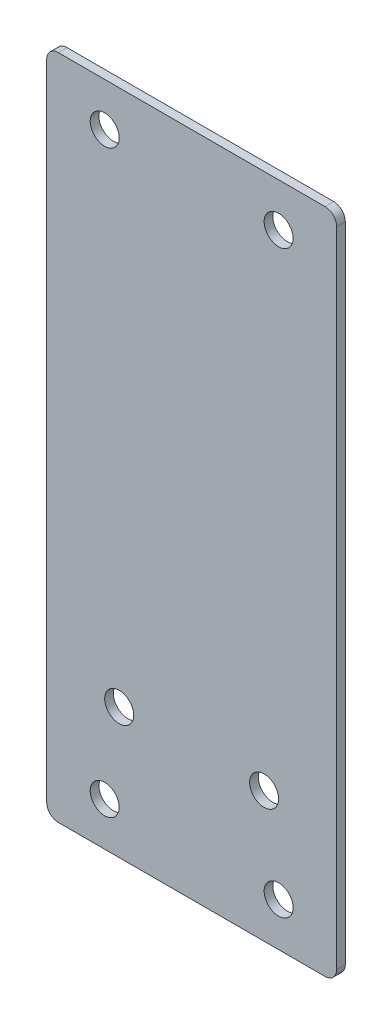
ISO-10303-21;
HEADER;
FILE_DESCRIPTION(('STEP AP214'),'2;1');
FILE_NAME('part.step','',(''),(''),'','','');
FILE_SCHEMA(('AUTOMOTIVE_DESIGN { 1 0 10303 214 1 1 1 1 }'));
ENDSEC;
DATA;
#1=APPLICATION_CONTEXT('core data for automotive mechanical design processes');
#2=APPLICATION_PROTOCOL_DEFINITION('international standard','automotive_design',2000,#1);
#3=PRODUCT_CONTEXT('',#1,'mechanical');
#4=PRODUCT('Part','Part','',(#3));
#5=PRODUCT_RELATED_PRODUCT_CATEGORY('part','',(#4));
#6=PRODUCT_DEFINITION_FORMATION('','',#4);
#7=PRODUCT_DEFINITION_CONTEXT('part definition',#1,'design');
#8=PRODUCT_DEFINITION('design','',#6,#7);
#9=PRODUCT_DEFINITION_SHAPE('','',#8);
#10=(LENGTH_UNIT() NAMED_UNIT(*) SI_UNIT(.MILLI.,.METRE.));
#11=(NAMED_UNIT(*) PLANE_ANGLE_UNIT() SI_UNIT($,.RADIAN.));
#12=(NAMED_UNIT(*) SI_UNIT($,.STERADIAN.) SOLID_ANGLE_UNIT());
#13=UNCERTAINTY_MEASURE_WITH_UNIT(LENGTH_MEASURE(1.E-05),#10,'distance_accuracy_value','');
#14=(GEOMETRIC_REPRESENTATION_CONTEXT(3) GLOBAL_UNCERTAINTY_ASSIGNED_CONTEXT((#13)) GLOBAL_UNIT_ASSIGNED_CONTEXT((#10,
#11,#12)) REPRESENTATION_CONTEXT('',''));
#15=CARTESIAN_POINT('',(0.,0.,0.));
#16=DIRECTION('',(0.,0.,1.));
#17=DIRECTION('',(1.,0.,0.));
#18=AXIS2_PLACEMENT_3D('',#15,#16,#17);
#19=CARTESIAN_POINT('',(0.,0.,3.));
#20=DIRECTION('',(1.,0.,0.));
#21=DIRECTION('',(0.,0.,-1.));
#22=AXIS2_PLACEMENT_3D('',#19,#20,#21);
#23=PLANE('',#22);
#24=DIRECTION('',(0.,-1.,0.));
#25=VECTOR('',#24,1.);
#26=CARTESIAN_POINT('',(0.,0.,0.));
#27=LINE('',#26,#25);
#28=CARTESIAN_POINT('',(0.,226.,0.));
#29=VERTEX_POINT('',#28);
#30=CARTESIAN_POINT('',(0.,4.,0.));
#31=VERTEX_POINT('',#30);
#32=EDGE_CURVE('E127',#29,#31,#27,.T.);
#33=ORIENTED_EDGE('',*,*,#32,.T.);
#34=DIRECTION('',(0.,0.,-1.));
#35=VECTOR('',#34,1.);
#36=CARTESIAN_POINT('',(0.,4.,3.));
#37=LINE('',#36,#35);
#38=CARTESIAN_POINT('',(0.,4.,3.));
#39=VERTEX_POINT('',#38);
#40=EDGE_CURVE('E105',#31,#39,#37,.F.);
#41=ORIENTED_EDGE('',*,*,#40,.T.);
#42=DIRECTION('',(0.,-1.,0.));
#43=VECTOR('',#42,1.);
#44=CARTESIAN_POINT('',(0.,0.,3.));
#45=LINE('',#44,#43);
#46=CARTESIAN_POINT('',(0.,226.,3.));
#47=VERTEX_POINT('',#46);
#48=EDGE_CURVE('E137',#47,#39,#45,.T.);
#49=ORIENTED_EDGE('',*,*,#48,.F.);
#50=DIRECTION('',(0.,0.,-1.));
#51=VECTOR('',#50,1.);
#52=CARTESIAN_POINT('',(0.,226.,3.));
#53=LINE('',#52,#51);
#54=EDGE_CURVE('E110',#47,#29,#53,.T.);
#55=ORIENTED_EDGE('',*,*,#54,.T.);
#56=EDGE_LOOP('',(#33,#41,#49,#55));
#57=FACE_BOUND('',#56,.T.);
#58=ADVANCED_FACE('F32',(#57),#23,.F.);
#59=CARTESIAN_POINT('',(0.,0.,3.));
#60=DIRECTION('',(0.,1.,0.));
#61=DIRECTION('',(0.,0.,1.));
#62=AXIS2_PLACEMENT_3D('',#59,#60,#61);
#63=PLANE('',#62);
#64=DIRECTION('',(1.,0.,0.));
#65=VECTOR('',#64,1.);
#66=CARTESIAN_POINT('',(0.,0.,3.));
#67=LINE('',#66,#65);
#68=CARTESIAN_POINT('',(4.,0.,3.));
#69=VERTEX_POINT('',#68);
#70=CARTESIAN_POINT('',(96.,0.,3.));
#71=VERTEX_POINT('',#70);
#72=EDGE_CURVE('E120',#69,#71,#67,.T.);
#73=ORIENTED_EDGE('',*,*,#72,.F.);
#74=DIRECTION('',(0.,0.,-1.));
#75=VECTOR('',#74,1.);
#76=CARTESIAN_POINT('',(4.,0.,3.));
#77=LINE('',#76,#75);
#78=CARTESIAN_POINT('',(4.,0.,0.));
#79=VERTEX_POINT('',#78);
#80=EDGE_CURVE('E104',#69,#79,#77,.T.);
#81=ORIENTED_EDGE('',*,*,#80,.T.);
#82=DIRECTION('',(1.,0.,0.));
#83=VECTOR('',#82,1.);
#84=CARTESIAN_POINT('',(0.,0.,0.));
#85=LINE('',#84,#83);
#86=CARTESIAN_POINT('',(96.,0.,0.));
#87=VERTEX_POINT('',#86);
#88=EDGE_CURVE('E117',#79,#87,#85,.T.);
#89=ORIENTED_EDGE('',*,*,#88,.T.);
#90=DIRECTION('',(0.,0.,-1.));
#91=VECTOR('',#90,1.);
#92=CARTESIAN_POINT('',(96.,0.,3.));
#93=LINE('',#92,#91);
#94=EDGE_CURVE('E122',#87,#71,#93,.F.);
#95=ORIENTED_EDGE('',*,*,#94,.T.);
#96=EDGE_LOOP('',(#73,#81,#89,#95));
#97=FACE_BOUND('',#96,.T.);
#98=ADVANCED_FACE('F116',(#97),#63,.F.);
#99=CARTESIAN_POINT('',(100.,0.,3.));
#100=DIRECTION('',(-1.,0.,0.));
#101=DIRECTION('',(0.,0.,1.));
#102=AXIS2_PLACEMENT_3D('',#99,#100,#101);
#103=PLANE('',#102);
#104=DIRECTION('',(0.,1.,0.));
#105=VECTOR('',#104,1.);
#106=CARTESIAN_POINT('',(100.,0.,3.));
#107=LINE('',#106,#105);
#108=CARTESIAN_POINT('',(100.,4.,3.));
#109=VERTEX_POINT('',#108);
#110=CARTESIAN_POINT('',(100.,226.,3.));
#111=VERTEX_POINT('',#110);
#112=EDGE_CURVE('E198',#109,#111,#107,.T.);
#113=ORIENTED_EDGE('',*,*,#112,.F.);
#114=DIRECTION('',(0.,0.,-1.));
#115=VECTOR('',#114,1.);
#116=CARTESIAN_POINT('',(100.,4.,3.));
#117=LINE('',#116,#115);
#118=CARTESIAN_POINT('',(100.,4.,0.));
#119=VERTEX_POINT('',#118);
#120=EDGE_CURVE('E156',#109,#119,#117,.T.);
#121=ORIENTED_EDGE('',*,*,#120,.T.);
#122=DIRECTION('',(0.,1.,0.));
#123=VECTOR('',#122,1.);
#124=CARTESIAN_POINT('',(100.,0.,0.));
#125=LINE('',#124,#123);
#126=CARTESIAN_POINT('',(100.,226.,0.));
#127=VERTEX_POINT('',#126);
#128=EDGE_CURVE('E126',#119,#127,#125,.T.);
#129=ORIENTED_EDGE('',*,*,#128,.T.);
#130=DIRECTION('',(0.,0.,-1.));
#131=VECTOR('',#130,1.);
#132=CARTESIAN_POINT('',(100.,226.,3.));
#133=LINE('',#132,#131);
#134=EDGE_CURVE('E154',#127,#111,#133,.F.);
#135=ORIENTED_EDGE('',*,*,#134,.T.);
#136=EDGE_LOOP('',(#113,#121,#129,#135));
#137=FACE_BOUND('',#136,.T.);
#138=ADVANCED_FACE('F213',(#137),#103,.F.);
#139=CARTESIAN_POINT('',(0.,230.,3.));
#140=DIRECTION('',(0.,-1.,0.));
#141=DIRECTION('',(0.,0.,-1.));
#142=AXIS2_PLACEMENT_3D('',#139,#140,#141);
#143=PLANE('',#142);
#144=DIRECTION('',(-1.,0.,0.));
#145=VECTOR('',#144,1.);
#146=CARTESIAN_POINT('',(0.,230.,3.));
#147=LINE('',#146,#145);
#148=CARTESIAN_POINT('',(96.,230.,3.));
#149=VERTEX_POINT('',#148);
#150=CARTESIAN_POINT('',(4.,230.,3.));
#151=VERTEX_POINT('',#150);
#152=EDGE_CURVE('E138',#149,#151,#147,.T.);
#153=ORIENTED_EDGE('',*,*,#152,.F.);
#154=DIRECTION('',(0.,0.,-1.));
#155=VECTOR('',#154,1.);
#156=CARTESIAN_POINT('',(96.,230.,3.));
#157=LINE('',#156,#155);
#158=CARTESIAN_POINT('',(96.,230.,0.));
#159=VERTEX_POINT('',#158);
#160=EDGE_CURVE('E11',#149,#159,#157,.T.);
#161=ORIENTED_EDGE('',*,*,#160,.T.);
#162=DIRECTION('',(-1.,0.,0.));
#163=VECTOR('',#162,1.);
#164=CARTESIAN_POINT('',(0.,230.,0.));
#165=LINE('',#164,#163);
#166=CARTESIAN_POINT('',(4.,230.,0.));
#167=VERTEX_POINT('',#166);
#168=EDGE_CURVE('E130',#159,#167,#165,.T.);
#169=ORIENTED_EDGE('',*,*,#168,.T.);
#170=DIRECTION('',(0.,0.,-1.));
#171=VECTOR('',#170,1.);
#172=CARTESIAN_POINT('',(4.,230.,3.));
#173=LINE('',#172,#171);
#174=EDGE_CURVE('E41',#167,#151,#173,.F.);
#175=ORIENTED_EDGE('',*,*,#174,.T.);
#176=EDGE_LOOP('',(#153,#161,#169,#175));
#177=FACE_BOUND('',#176,.T.);
#178=ADVANCED_FACE('F207',(#177),#143,.F.);
#179=CARTESIAN_POINT('',(0.,0.,3.));
#180=DIRECTION('',(0.,0.,-1.));
#181=DIRECTION('',(-1.,0.,0.));
#182=AXIS2_PLACEMENT_3D('',#179,#180,#181);
#183=PLANE('',#182);
#184=CARTESIAN_POINT('',(75.,45.,3.));
#185=DIRECTION('',(0.,0.,1.));
#186=DIRECTION('',(1.,0.,0.));
#187=AXIS2_PLACEMENT_3D('',#184,#185,#186);
#188=CIRCLE('',#187,5.00000000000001);
#189=CARTESIAN_POINT('',(80.,45.,3.));
#190=VERTEX_POINT('',#189);
#191=EDGE_CURVE('E173',#190,#190,#188,.T.);
#192=ORIENTED_EDGE('',*,*,#191,.F.);
#193=EDGE_LOOP('',(#192));
#194=FACE_BOUND('',#193,.T.);
#195=CARTESIAN_POINT('',(25.,45.,3.));
#196=DIRECTION('',(0.,0.,1.));
#197=DIRECTION('',(1.,0.,0.));
#198=AXIS2_PLACEMENT_3D('',#195,#196,#197);
#199=CIRCLE('',#198,5.);
#200=CARTESIAN_POINT('',(30.,45.,3.));
#201=VERTEX_POINT('',#200);
#202=EDGE_CURVE('E162',#201,#201,#199,.T.);
#203=ORIENTED_EDGE('',*,*,#202,.F.);
#204=EDGE_LOOP('',(#203));
#205=FACE_BOUND('',#204,.T.);
#206=CARTESIAN_POINT('',(80.,15.,3.));
#207=DIRECTION('',(0.,0.,1.));
#208=DIRECTION('',(1.,0.,0.));
#209=AXIS2_PLACEMENT_3D('',#206,#207,#208);
#210=CIRCLE('',#209,5.);
#211=CARTESIAN_POINT('',(85.,15.,3.));
#212=VERTEX_POINT('',#211);
#213=EDGE_CURVE('E161',#212,#212,#210,.T.);
#214=ORIENTED_EDGE('',*,*,#213,.F.);
#215=EDGE_LOOP('',(#214));
#216=FACE_BOUND('',#215,.T.);
#217=CARTESIAN_POINT('',(20.,15.,3.));
#218=DIRECTION('',(0.,0.,1.));
#219=DIRECTION('',(1.,0.,0.));
#220=AXIS2_PLACEMENT_3D('',#217,#218,#219);
#221=CIRCLE('',#220,5.);
#222=CARTESIAN_POINT('',(25.,15.,3.));
#223=VERTEX_POINT('',#222);
#224=EDGE_CURVE('E177',#223,#223,#221,.T.);
#225=ORIENTED_EDGE('',*,*,#224,.F.);
#226=EDGE_LOOP('',(#225));
#227=FACE_BOUND('',#226,.T.);
#228=CARTESIAN_POINT('',(80.,215.,3.));
#229=DIRECTION('',(0.,0.,1.));
#230=DIRECTION('',(1.,0.,0.));
#231=AXIS2_PLACEMENT_3D('',#228,#229,#230);
#232=CIRCLE('',#231,5.00000000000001);
#233=CARTESIAN_POINT('',(85.,215.,3.));
#234=VERTEX_POINT('',#233);
#235=EDGE_CURVE('E182',#234,#234,#232,.T.);
#236=ORIENTED_EDGE('',*,*,#235,.F.);
#237=EDGE_LOOP('',(#236));
#238=FACE_BOUND('',#237,.T.);
#239=CARTESIAN_POINT('',(20.,215.,3.));
#240=DIRECTION('',(0.,0.,1.));
#241=DIRECTION('',(1.,0.,0.));
#242=AXIS2_PLACEMENT_3D('',#239,#240,#241);
#243=CIRCLE('',#242,5.);
#244=CARTESIAN_POINT('',(25.,215.,3.));
#245=VERTEX_POINT('',#244);
#246=EDGE_CURVE('E188',#245,#245,#243,.T.);
#247=ORIENTED_EDGE('',*,*,#246,.F.);
#248=EDGE_LOOP('',(#247));
#249=FACE_BOUND('',#248,.T.);
#250=ORIENTED_EDGE('',*,*,#48,.T.);
#251=CARTESIAN_POINT('',(4.,4.,3.));
#252=DIRECTION('',(0.,0.,-1.));
#253=DIRECTION('',(-1.,0.,0.));
#254=AXIS2_PLACEMENT_3D('',#251,#252,#253);
#255=CIRCLE('',#254,4.);
#256=EDGE_CURVE('E152',#39,#69,#255,.F.);
#257=ORIENTED_EDGE('',*,*,#256,.T.);
#258=ORIENTED_EDGE('',*,*,#72,.T.);
#259=CARTESIAN_POINT('',(96.,4.,3.));
#260=DIRECTION('',(0.,0.,-1.));
#261=DIRECTION('',(-1.,0.,0.));
#262=AXIS2_PLACEMENT_3D('',#259,#260,#261);
#263=CIRCLE('',#262,4.);
#264=EDGE_CURVE('E150',#71,#109,#263,.F.);
#265=ORIENTED_EDGE('',*,*,#264,.T.);
#266=ORIENTED_EDGE('',*,*,#112,.T.);
#267=CARTESIAN_POINT('',(96.,226.,3.));
#268=DIRECTION('',(0.,0.,-1.));
#269=DIRECTION('',(-1.,0.,0.));
#270=AXIS2_PLACEMENT_3D('',#267,#268,#269);
#271=CIRCLE('',#270,4.);
#272=EDGE_CURVE('E55',#111,#149,#271,.F.);
#273=ORIENTED_EDGE('',*,*,#272,.T.);
#274=ORIENTED_EDGE('',*,*,#152,.T.);
#275=CARTESIAN_POINT('',(4.,226.,3.));
#276=DIRECTION('',(0.,0.,-1.));
#277=DIRECTION('',(-1.,0.,0.));
#278=AXIS2_PLACEMENT_3D('',#275,#276,#277);
#279=CIRCLE('',#278,4.);
#280=EDGE_CURVE('E147',#151,#47,#279,.F.);
#281=ORIENTED_EDGE('',*,*,#280,.T.);
#282=EDGE_LOOP('',(#250,#257,#258,#265,#266,#273,#274,#281));
#283=FACE_BOUND('',#282,.T.);
#284=ADVANCED_FACE('F200',(#194,#205,#216,#227,#238,#249,#283),#183,.F.);
#285=CARTESIAN_POINT('',(0.,0.,0.));
#286=DIRECTION('',(0.,0.,-1.));
#287=DIRECTION('',(-1.,0.,0.));
#288=AXIS2_PLACEMENT_3D('',#285,#286,#287);
#289=PLANE('',#288);
#290=CARTESIAN_POINT('',(75.,45.,0.));
#291=DIRECTION('',(0.,0.,-1.));
#292=DIRECTION('',(-1.,0.,0.));
#293=AXIS2_PLACEMENT_3D('',#290,#291,#292);
#294=CIRCLE('',#293,5.00000000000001);
#295=CARTESIAN_POINT('',(70.,45.,0.));
#296=VERTEX_POINT('',#295);
#297=EDGE_CURVE('E36',#296,#296,#294,.T.);
#298=ORIENTED_EDGE('',*,*,#297,.F.);
#299=EDGE_LOOP('',(#298));
#300=FACE_BOUND('',#299,.T.);
#301=CARTESIAN_POINT('',(25.,45.,0.));
#302=DIRECTION('',(0.,0.,-1.));
#303=DIRECTION('',(-1.,0.,0.));
#304=AXIS2_PLACEMENT_3D('',#301,#302,#303);
#305=CIRCLE('',#304,5.);
#306=CARTESIAN_POINT('',(20.,45.,0.));
#307=VERTEX_POINT('',#306);
#308=EDGE_CURVE('E159',#307,#307,#305,.T.);
#309=ORIENTED_EDGE('',*,*,#308,.F.);
#310=EDGE_LOOP('',(#309));
#311=FACE_BOUND('',#310,.T.);
#312=CARTESIAN_POINT('',(80.,15.,0.));
#313=DIRECTION('',(0.,0.,1.));
#314=DIRECTION('',(1.,0.,0.));
#315=AXIS2_PLACEMENT_3D('',#312,#313,#314);
#316=CIRCLE('',#315,5.);
#317=CARTESIAN_POINT('',(85.,15.,0.));
#318=VERTEX_POINT('',#317);
#319=EDGE_CURVE('E166',#318,#318,#316,.T.);
#320=ORIENTED_EDGE('',*,*,#319,.T.);
#321=EDGE_LOOP('',(#320));
#322=FACE_BOUND('',#321,.T.);
#323=CARTESIAN_POINT('',(20.,15.,0.));
#324=DIRECTION('',(0.,0.,1.));
#325=DIRECTION('',(1.,0.,0.));
#326=AXIS2_PLACEMENT_3D('',#323,#324,#325);
#327=CIRCLE('',#326,5.);
#328=CARTESIAN_POINT('',(25.,15.,0.));
#329=VERTEX_POINT('',#328);
#330=EDGE_CURVE('E179',#329,#329,#327,.T.);
#331=ORIENTED_EDGE('',*,*,#330,.T.);
#332=EDGE_LOOP('',(#331));
#333=FACE_BOUND('',#332,.T.);
#334=CARTESIAN_POINT('',(80.,215.,0.));
#335=DIRECTION('',(0.,0.,1.));
#336=DIRECTION('',(1.,0.,0.));
#337=AXIS2_PLACEMENT_3D('',#334,#335,#336);
#338=CIRCLE('',#337,5.00000000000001);
#339=CARTESIAN_POINT('',(85.,215.,0.));
#340=VERTEX_POINT('',#339);
#341=EDGE_CURVE('E185',#340,#340,#338,.T.);
#342=ORIENTED_EDGE('',*,*,#341,.T.);
#343=EDGE_LOOP('',(#342));
#344=FACE_BOUND('',#343,.T.);
#345=CARTESIAN_POINT('',(20.,215.,0.));
#346=DIRECTION('',(0.,0.,1.));
#347=DIRECTION('',(1.,0.,0.));
#348=AXIS2_PLACEMENT_3D('',#345,#346,#347);
#349=CIRCLE('',#348,5.);
#350=CARTESIAN_POINT('',(25.,215.,0.));
#351=VERTEX_POINT('',#350);
#352=EDGE_CURVE('E132',#351,#351,#349,.T.);
#353=ORIENTED_EDGE('',*,*,#352,.T.);
#354=EDGE_LOOP('',(#353));
#355=FACE_BOUND('',#354,.T.);
#356=ORIENTED_EDGE('',*,*,#88,.F.);
#357=CARTESIAN_POINT('',(4.,4.,0.));
#358=DIRECTION('',(0.,0.,-1.));
#359=DIRECTION('',(-1.,0.,0.));
#360=AXIS2_PLACEMENT_3D('',#357,#358,#359);
#361=CIRCLE('',#360,4.);
#362=EDGE_CURVE('E100',#79,#31,#361,.T.);
#363=ORIENTED_EDGE('',*,*,#362,.T.);
#364=ORIENTED_EDGE('',*,*,#32,.F.);
#365=CARTESIAN_POINT('',(4.,226.,0.));
#366=DIRECTION('',(0.,0.,-1.));
#367=DIRECTION('',(-1.,0.,0.));
#368=AXIS2_PLACEMENT_3D('',#365,#366,#367);
#369=CIRCLE('',#368,4.);
#370=EDGE_CURVE('E121',#29,#167,#369,.T.);
#371=ORIENTED_EDGE('',*,*,#370,.T.);
#372=ORIENTED_EDGE('',*,*,#168,.F.);
#373=CARTESIAN_POINT('',(96.,226.,0.));
#374=DIRECTION('',(0.,0.,-1.));
#375=DIRECTION('',(-1.,0.,0.));
#376=AXIS2_PLACEMENT_3D('',#373,#374,#375);
#377=CIRCLE('',#376,4.);
#378=EDGE_CURVE('E141',#159,#127,#377,.T.);
#379=ORIENTED_EDGE('',*,*,#378,.T.);
#380=ORIENTED_EDGE('',*,*,#128,.F.);
#381=CARTESIAN_POINT('',(96.,4.,0.));
#382=DIRECTION('',(0.,0.,-1.));
#383=DIRECTION('',(-1.,0.,0.));
#384=AXIS2_PLACEMENT_3D('',#381,#382,#383);
#385=CIRCLE('',#384,4.);
#386=EDGE_CURVE('E111',#119,#87,#385,.T.);
#387=ORIENTED_EDGE('',*,*,#386,.T.);
#388=EDGE_LOOP('',(#356,#363,#364,#371,#372,#379,#380,#387));
#389=FACE_BOUND('',#388,.T.);
#390=ADVANCED_FACE('F124',(#300,#311,#322,#333,#344,#355,#389),#289,.T.);
#391=CARTESIAN_POINT('',(20.,215.,0.));
#392=DIRECTION('',(0.,0.,1.));
#393=DIRECTION('',(1.,0.,0.));
#394=AXIS2_PLACEMENT_3D('',#391,#392,#393);
#395=CYLINDRICAL_SURFACE('',#394,5.);
#396=ORIENTED_EDGE('',*,*,#352,.F.);
#397=EDGE_LOOP('',(#396));
#398=FACE_BOUND('',#397,.T.);
#399=ORIENTED_EDGE('',*,*,#246,.T.);
#400=EDGE_LOOP('',(#399));
#401=FACE_BOUND('',#400,.T.);
#402=ADVANCED_FACE('F239',(#398,#401),#395,.F.);
#403=CARTESIAN_POINT('',(80.,215.,0.));
#404=DIRECTION('',(0.,0.,1.));
#405=DIRECTION('',(1.,0.,0.));
#406=AXIS2_PLACEMENT_3D('',#403,#404,#405);
#407=CYLINDRICAL_SURFACE('',#406,5.00000000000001);
#408=ORIENTED_EDGE('',*,*,#341,.F.);
#409=EDGE_LOOP('',(#408));
#410=FACE_BOUND('',#409,.T.);
#411=ORIENTED_EDGE('',*,*,#235,.T.);
#412=EDGE_LOOP('',(#411));
#413=FACE_BOUND('',#412,.T.);
#414=ADVANCED_FACE('F246',(#410,#413),#407,.F.);
#415=CARTESIAN_POINT('',(20.,15.,0.));
#416=DIRECTION('',(0.,0.,1.));
#417=DIRECTION('',(1.,0.,0.));
#418=AXIS2_PLACEMENT_3D('',#415,#416,#417);
#419=CYLINDRICAL_SURFACE('',#418,5.);
#420=ORIENTED_EDGE('',*,*,#330,.F.);
#421=EDGE_LOOP('',(#420));
#422=FACE_BOUND('',#421,.T.);
#423=ORIENTED_EDGE('',*,*,#224,.T.);
#424=EDGE_LOOP('',(#423));
#425=FACE_BOUND('',#424,.T.);
#426=ADVANCED_FACE('F250',(#422,#425),#419,.F.);
#427=CARTESIAN_POINT('',(80.,15.,0.));
#428=DIRECTION('',(0.,0.,1.));
#429=DIRECTION('',(1.,0.,0.));
#430=AXIS2_PLACEMENT_3D('',#427,#428,#429);
#431=CYLINDRICAL_SURFACE('',#430,5.);
#432=ORIENTED_EDGE('',*,*,#319,.F.);
#433=EDGE_LOOP('',(#432));
#434=FACE_BOUND('',#433,.T.);
#435=ORIENTED_EDGE('',*,*,#213,.T.);
#436=EDGE_LOOP('',(#435));
#437=FACE_BOUND('',#436,.T.);
#438=ADVANCED_FACE('F224',(#434,#437),#431,.F.);
#439=CARTESIAN_POINT('',(4.,4.,3.));
#440=DIRECTION('',(0.,0.,-1.));
#441=DIRECTION('',(-1.,0.,0.));
#442=AXIS2_PLACEMENT_3D('',#439,#440,#441);
#443=CYLINDRICAL_SURFACE('',#442,4.);
#444=ORIENTED_EDGE('',*,*,#256,.F.);
#445=ORIENTED_EDGE('',*,*,#40,.F.);
#446=ORIENTED_EDGE('',*,*,#362,.F.);
#447=ORIENTED_EDGE('',*,*,#80,.F.);
#448=EDGE_LOOP('',(#444,#445,#446,#447));
#449=FACE_BOUND('',#448,.T.);
#450=ADVANCED_FACE('F103',(#449),#443,.T.);
#451=CARTESIAN_POINT('',(96.,4.,3.));
#452=DIRECTION('',(0.,0.,-1.));
#453=DIRECTION('',(-1.,0.,0.));
#454=AXIS2_PLACEMENT_3D('',#451,#452,#453);
#455=CYLINDRICAL_SURFACE('',#454,4.);
#456=ORIENTED_EDGE('',*,*,#264,.F.);
#457=ORIENTED_EDGE('',*,*,#94,.F.);
#458=ORIENTED_EDGE('',*,*,#386,.F.);
#459=ORIENTED_EDGE('',*,*,#120,.F.);
#460=EDGE_LOOP('',(#456,#457,#458,#459));
#461=FACE_BOUND('',#460,.T.);
#462=ADVANCED_FACE('F217',(#461),#455,.T.);
#463=CARTESIAN_POINT('',(96.,226.,3.));
#464=DIRECTION('',(0.,0.,-1.));
#465=DIRECTION('',(-1.,0.,0.));
#466=AXIS2_PLACEMENT_3D('',#463,#464,#465);
#467=CYLINDRICAL_SURFACE('',#466,4.);
#468=ORIENTED_EDGE('',*,*,#272,.F.);
#469=ORIENTED_EDGE('',*,*,#134,.F.);
#470=ORIENTED_EDGE('',*,*,#378,.F.);
#471=ORIENTED_EDGE('',*,*,#160,.F.);
#472=EDGE_LOOP('',(#468,#469,#470,#471));
#473=FACE_BOUND('',#472,.T.);
#474=ADVANCED_FACE('F209',(#473),#467,.T.);
#475=CARTESIAN_POINT('',(4.,226.,3.));
#476=DIRECTION('',(0.,0.,-1.));
#477=DIRECTION('',(-1.,0.,0.));
#478=AXIS2_PLACEMENT_3D('',#475,#476,#477);
#479=CYLINDRICAL_SURFACE('',#478,4.);
#480=ORIENTED_EDGE('',*,*,#280,.F.);
#481=ORIENTED_EDGE('',*,*,#174,.F.);
#482=ORIENTED_EDGE('',*,*,#370,.F.);
#483=ORIENTED_EDGE('',*,*,#54,.F.);
#484=EDGE_LOOP('',(#480,#481,#482,#483));
#485=FACE_BOUND('',#484,.T.);
#486=ADVANCED_FACE('F34',(#485),#479,.T.);
#487=CARTESIAN_POINT('',(25.,45.,-7.));
#488=DIRECTION('',(0.,0.,1.));
#489=DIRECTION('',(1.,0.,0.));
#490=AXIS2_PLACEMENT_3D('',#487,#488,#489);
#491=CYLINDRICAL_SURFACE('',#490,5.);
#492=ORIENTED_EDGE('',*,*,#308,.T.);
#493=EDGE_LOOP('',(#492));
#494=FACE_BOUND('',#493,.T.);
#495=ORIENTED_EDGE('',*,*,#202,.T.);
#496=EDGE_LOOP('',(#495));
#497=FACE_BOUND('',#496,.T.);
#498=ADVANCED_FACE('F258',(#494,#497),#491,.F.);
#499=CARTESIAN_POINT('',(75.,45.,-7.));
#500=DIRECTION('',(0.,0.,1.));
#501=DIRECTION('',(1.,0.,0.));
#502=AXIS2_PLACEMENT_3D('',#499,#500,#501);
#503=CYLINDRICAL_SURFACE('',#502,5.00000000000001);
#504=ORIENTED_EDGE('',*,*,#297,.T.);
#505=EDGE_LOOP('',(#504));
#506=FACE_BOUND('',#505,.T.);
#507=ORIENTED_EDGE('',*,*,#191,.T.);
#508=EDGE_LOOP('',(#507));
#509=FACE_BOUND('',#508,.T.);
#510=ADVANCED_FACE('F261',(#506,#509),#503,.F.);
#511=CLOSED_SHELL('',(#58,#98,#138,#178,#284,#390,#402,#414,#426,#438,#450,#462,#474,#486,#498,#510));
#512=MANIFOLD_SOLID_BREP('B2',#511);
#513=ADVANCED_BREP_SHAPE_REPRESENTATION('',(#18,#512),#14);
#514=SHAPE_DEFINITION_REPRESENTATION(#9,#513);
ENDSEC;
END-ISO-10303-21;
